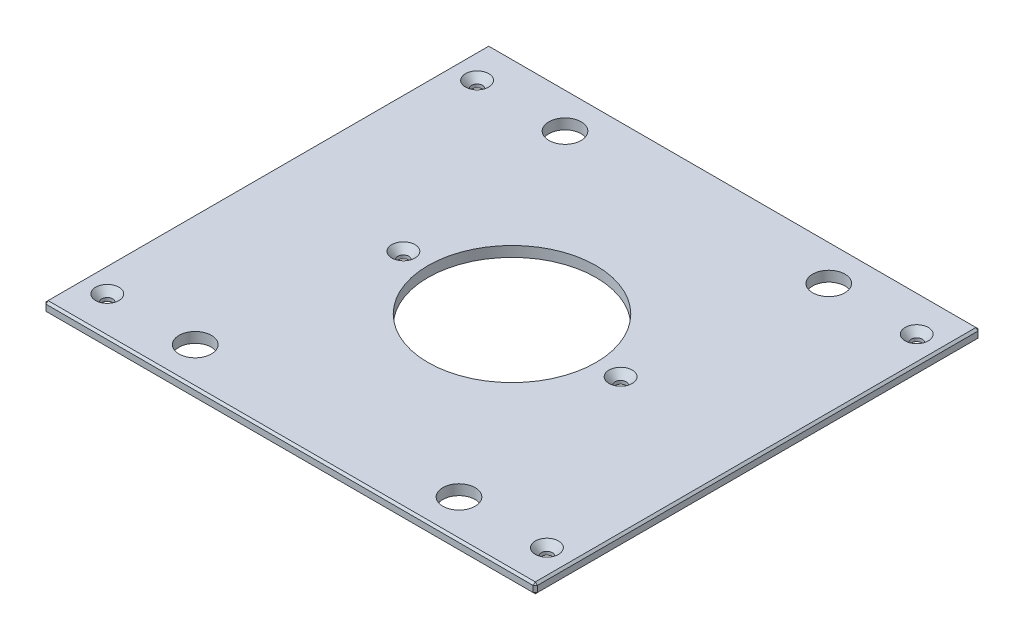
ISO-10303-21;
HEADER;
FILE_DESCRIPTION(('STEP AP214'),'2;1');
FILE_NAME('part.step','',(''),(''),'','','');
FILE_SCHEMA(('AUTOMOTIVE_DESIGN { 1 0 10303 214 1 1 1 1 }'));
ENDSEC;
DATA;
#1=APPLICATION_CONTEXT('core data for automotive mechanical design processes');
#2=APPLICATION_PROTOCOL_DEFINITION('international standard','automotive_design',2000,#1);
#3=PRODUCT_CONTEXT('',#1,'mechanical');
#4=PRODUCT('Part','Part','',(#3));
#5=PRODUCT_RELATED_PRODUCT_CATEGORY('part','',(#4));
#6=PRODUCT_DEFINITION_FORMATION('','',#4);
#7=PRODUCT_DEFINITION_CONTEXT('part definition',#1,'design');
#8=PRODUCT_DEFINITION('design','',#6,#7);
#9=PRODUCT_DEFINITION_SHAPE('','',#8);
#10=(LENGTH_UNIT() NAMED_UNIT(*) SI_UNIT(.MILLI.,.METRE.));
#11=(NAMED_UNIT(*) PLANE_ANGLE_UNIT() SI_UNIT($,.RADIAN.));
#12=(NAMED_UNIT(*) SI_UNIT($,.STERADIAN.) SOLID_ANGLE_UNIT());
#13=UNCERTAINTY_MEASURE_WITH_UNIT(LENGTH_MEASURE(1.E-05),#10,'distance_accuracy_value','');
#14=(GEOMETRIC_REPRESENTATION_CONTEXT(3) GLOBAL_UNCERTAINTY_ASSIGNED_CONTEXT((#13)) GLOBAL_UNIT_ASSIGNED_CONTEXT((#10,
#11,#12)) REPRESENTATION_CONTEXT('',''));
#15=CARTESIAN_POINT('',(0.,0.,0.));
#16=DIRECTION('',(0.,0.,1.));
#17=DIRECTION('',(1.,0.,0.));
#18=AXIS2_PLACEMENT_3D('',#15,#16,#17);
#19=CARTESIAN_POINT('',(-150.8125,6.35,-136.525));
#20=DIRECTION('',(1.,0.,0.));
#21=DIRECTION('',(0.,0.,-1.));
#22=AXIS2_PLACEMENT_3D('',#19,#20,#21);
#23=PLANE('',#22);
#24=DIRECTION('',(0.,0.,-1.));
#25=VECTOR('',#24,1.);
#26=CARTESIAN_POINT('',(-150.8125,5.08000000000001,-136.525));
#27=LINE('',#26,#25);
#28=CARTESIAN_POINT('',(-150.8125,5.08000000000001,135.255));
#29=VERTEX_POINT('',#28);
#30=CARTESIAN_POINT('',(-150.8125,5.08000000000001,-135.255));
#31=VERTEX_POINT('',#30);
#32=EDGE_CURVE('E135',#29,#31,#27,.T.);
#33=ORIENTED_EDGE('',*,*,#32,.T.);
#34=DIRECTION('',(0.,-1.,0.));
#35=VECTOR('',#34,1.);
#36=CARTESIAN_POINT('',(-150.8125,6.35,-135.255));
#37=LINE('',#36,#35);
#38=CARTESIAN_POINT('',(-150.8125,1.26999999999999,-135.255));
#39=VERTEX_POINT('',#38);
#40=EDGE_CURVE('E131',#31,#39,#37,.T.);
#41=ORIENTED_EDGE('',*,*,#40,.T.);
#42=DIRECTION('',(0.,0.,1.));
#43=VECTOR('',#42,1.);
#44=CARTESIAN_POINT('',(-150.8125,1.26999999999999,-136.525));
#45=LINE('',#44,#43);
#46=CARTESIAN_POINT('',(-150.8125,1.26999999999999,135.255));
#47=VERTEX_POINT('',#46);
#48=EDGE_CURVE('E126',#39,#47,#45,.T.);
#49=ORIENTED_EDGE('',*,*,#48,.T.);
#50=DIRECTION('',(0.,1.,0.));
#51=VECTOR('',#50,1.);
#52=CARTESIAN_POINT('',(-150.8125,6.35,135.255));
#53=LINE('',#52,#51);
#54=EDGE_CURVE('E128',#47,#29,#53,.T.);
#55=ORIENTED_EDGE('',*,*,#54,.T.);
#56=EDGE_LOOP('',(#33,#41,#49,#55));
#57=FACE_BOUND('',#56,.T.);
#58=ADVANCED_FACE('F35',(#57),#23,.F.);
#59=CARTESIAN_POINT('',(-150.8125,6.35,136.525));
#60=DIRECTION('',(0.,0.,-1.));
#61=DIRECTION('',(-1.,0.,0.));
#62=AXIS2_PLACEMENT_3D('',#59,#60,#61);
#63=PLANE('',#62);
#64=DIRECTION('',(1.,0.,0.));
#65=VECTOR('',#64,1.);
#66=CARTESIAN_POINT('',(-150.8125,1.26999999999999,136.525));
#67=LINE('',#66,#65);
#68=CARTESIAN_POINT('',(-149.5425,1.26999999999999,136.525));
#69=VERTEX_POINT('',#68);
#70=CARTESIAN_POINT('',(149.5425,1.26999999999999,136.525));
#71=VERTEX_POINT('',#70);
#72=EDGE_CURVE('E58',#69,#71,#67,.T.);
#73=ORIENTED_EDGE('',*,*,#72,.T.);
#74=DIRECTION('',(0.,1.,0.));
#75=VECTOR('',#74,1.);
#76=CARTESIAN_POINT('',(149.5425,6.35,136.525));
#77=LINE('',#76,#75);
#78=CARTESIAN_POINT('',(149.5425,5.08000000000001,136.525));
#79=VERTEX_POINT('',#78);
#80=EDGE_CURVE('E11',#71,#79,#77,.T.);
#81=ORIENTED_EDGE('',*,*,#80,.T.);
#82=DIRECTION('',(-1.,0.,0.));
#83=VECTOR('',#82,1.);
#84=CARTESIAN_POINT('',(-150.8125,5.08000000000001,136.525));
#85=LINE('',#84,#83);
#86=CARTESIAN_POINT('',(-149.5425,5.08000000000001,136.525));
#87=VERTEX_POINT('',#86);
#88=EDGE_CURVE('E44',#79,#87,#85,.T.);
#89=ORIENTED_EDGE('',*,*,#88,.T.);
#90=DIRECTION('',(0.,-1.,0.));
#91=VECTOR('',#90,1.);
#92=CARTESIAN_POINT('',(-149.5425,6.35,136.525));
#93=LINE('',#92,#91);
#94=EDGE_CURVE('E279',#87,#69,#93,.T.);
#95=ORIENTED_EDGE('',*,*,#94,.T.);
#96=EDGE_LOOP('',(#73,#81,#89,#95));
#97=FACE_BOUND('',#96,.T.);
#98=ADVANCED_FACE('F348',(#97),#63,.F.);
#99=CARTESIAN_POINT('',(150.8125,6.35,-136.525));
#100=DIRECTION('',(-1.,0.,0.));
#101=DIRECTION('',(0.,0.,1.));
#102=AXIS2_PLACEMENT_3D('',#99,#100,#101);
#103=PLANE('',#102);
#104=DIRECTION('',(0.,0.,-1.));
#105=VECTOR('',#104,1.);
#106=CARTESIAN_POINT('',(150.8125,1.26999999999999,-136.525));
#107=LINE('',#106,#105);
#108=CARTESIAN_POINT('',(150.8125,1.26999999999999,135.255));
#109=VERTEX_POINT('',#108);
#110=CARTESIAN_POINT('',(150.8125,1.26999999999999,-135.255));
#111=VERTEX_POINT('',#110);
#112=EDGE_CURVE('E274',#109,#111,#107,.T.);
#113=ORIENTED_EDGE('',*,*,#112,.T.);
#114=DIRECTION('',(0.,1.,0.));
#115=VECTOR('',#114,1.);
#116=CARTESIAN_POINT('',(150.8125,6.35,-135.255));
#117=LINE('',#116,#115);
#118=CARTESIAN_POINT('',(150.8125,5.08000000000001,-135.255));
#119=VERTEX_POINT('',#118);
#120=EDGE_CURVE('E276',#111,#119,#117,.T.);
#121=ORIENTED_EDGE('',*,*,#120,.T.);
#122=DIRECTION('',(0.,0.,1.));
#123=VECTOR('',#122,1.);
#124=CARTESIAN_POINT('',(150.8125,5.08000000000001,136.525));
#125=LINE('',#124,#123);
#126=CARTESIAN_POINT('',(150.8125,5.08000000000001,135.255));
#127=VERTEX_POINT('',#126);
#128=EDGE_CURVE('E272',#119,#127,#125,.T.);
#129=ORIENTED_EDGE('',*,*,#128,.T.);
#130=DIRECTION('',(0.,-1.,0.));
#131=VECTOR('',#130,1.);
#132=CARTESIAN_POINT('',(150.8125,6.35,135.255));
#133=LINE('',#132,#131);
#134=EDGE_CURVE('E270',#127,#109,#133,.T.);
#135=ORIENTED_EDGE('',*,*,#134,.T.);
#136=EDGE_LOOP('',(#113,#121,#129,#135));
#137=FACE_BOUND('',#136,.T.);
#138=ADVANCED_FACE('F335',(#137),#103,.F.);
#139=CARTESIAN_POINT('',(-150.8125,6.35,-136.525));
#140=DIRECTION('',(0.,0.,1.));
#141=DIRECTION('',(1.,0.,0.));
#142=AXIS2_PLACEMENT_3D('',#139,#140,#141);
#143=PLANE('',#142);
#144=DIRECTION('',(-1.,0.,0.));
#145=VECTOR('',#144,1.);
#146=CARTESIAN_POINT('',(-150.8125,1.26999999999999,-136.525));
#147=LINE('',#146,#145);
#148=CARTESIAN_POINT('',(149.5425,1.26999999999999,-136.525));
#149=VERTEX_POINT('',#148);
#150=CARTESIAN_POINT('',(-149.5425,1.26999999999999,-136.525));
#151=VERTEX_POINT('',#150);
#152=EDGE_CURVE('E246',#149,#151,#147,.T.);
#153=ORIENTED_EDGE('',*,*,#152,.T.);
#154=DIRECTION('',(0.,1.,0.));
#155=VECTOR('',#154,1.);
#156=CARTESIAN_POINT('',(-149.5425,6.35,-136.525));
#157=LINE('',#156,#155);
#158=CARTESIAN_POINT('',(-149.5425,5.08000000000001,-136.525));
#159=VERTEX_POINT('',#158);
#160=EDGE_CURVE('E250',#151,#159,#157,.T.);
#161=ORIENTED_EDGE('',*,*,#160,.T.);
#162=DIRECTION('',(1.,0.,0.));
#163=VECTOR('',#162,1.);
#164=CARTESIAN_POINT('',(150.8125,5.08000000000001,-136.525));
#165=LINE('',#164,#163);
#166=CARTESIAN_POINT('',(149.5425,5.08000000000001,-136.525));
#167=VERTEX_POINT('',#166);
#168=EDGE_CURVE('E248',#159,#167,#165,.T.);
#169=ORIENTED_EDGE('',*,*,#168,.T.);
#170=DIRECTION('',(0.,-1.,0.));
#171=VECTOR('',#170,1.);
#172=CARTESIAN_POINT('',(149.5425,6.35,-136.525));
#173=LINE('',#172,#171);
#174=EDGE_CURVE('E244',#167,#149,#173,.T.);
#175=ORIENTED_EDGE('',*,*,#174,.T.);
#176=EDGE_LOOP('',(#153,#161,#169,#175));
#177=FACE_BOUND('',#176,.T.);
#178=ADVANCED_FACE('F309',(#177),#143,.F.);
#179=CARTESIAN_POINT('',(0.,6.35,0.));
#180=DIRECTION('',(0.,1.,0.));
#181=DIRECTION('',(0.,0.,1.));
#182=AXIS2_PLACEMENT_3D('',#179,#180,#181);
#183=PLANE('',#182);
#184=CARTESIAN_POINT('',(134.9375,6.35,-113.50498));
#185=DIRECTION('',(0.,1.,0.));
#186=DIRECTION('',(0.,0.,1.));
#187=AXIS2_PLACEMENT_3D('',#184,#185,#186);
#188=CIRCLE('',#187,7.13739999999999);
#189=CARTESIAN_POINT('',(134.9375,6.35,-106.36758));
#190=VERTEX_POINT('',#189);
#191=EDGE_CURVE('E752',#190,#190,#188,.T.);
#192=ORIENTED_EDGE('',*,*,#191,.F.);
#193=EDGE_LOOP('',(#192));
#194=FACE_BOUND('',#193,.T.);
#195=CARTESIAN_POINT('',(134.9375,6.35,113.50498));
#196=DIRECTION('',(0.,1.,0.));
#197=DIRECTION('',(0.,0.,1.));
#198=AXIS2_PLACEMENT_3D('',#195,#196,#197);
#199=CIRCLE('',#198,7.13739999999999);
#200=CARTESIAN_POINT('',(134.9375,6.35,120.64238));
#201=VERTEX_POINT('',#200);
#202=EDGE_CURVE('E756',#201,#201,#199,.T.);
#203=ORIENTED_EDGE('',*,*,#202,.F.);
#204=EDGE_LOOP('',(#203));
#205=FACE_BOUND('',#204,.T.);
#206=CARTESIAN_POINT('',(-134.9375,6.35,113.50498));
#207=DIRECTION('',(0.,1.,0.));
#208=DIRECTION('',(0.,0.,1.));
#209=AXIS2_PLACEMENT_3D('',#206,#207,#208);
#210=CIRCLE('',#209,7.13739999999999);
#211=CARTESIAN_POINT('',(-134.9375,6.35,120.64238));
#212=VERTEX_POINT('',#211);
#213=EDGE_CURVE('E760',#212,#212,#210,.T.);
#214=ORIENTED_EDGE('',*,*,#213,.F.);
#215=EDGE_LOOP('',(#214));
#216=FACE_BOUND('',#215,.T.);
#217=CARTESIAN_POINT('',(-66.675,6.35,0.));
#218=DIRECTION('',(0.,1.,0.));
#219=DIRECTION('',(0.,0.,1.));
#220=AXIS2_PLACEMENT_3D('',#217,#218,#219);
#221=CIRCLE('',#220,7.1374);
#222=CARTESIAN_POINT('',(-66.675,6.35,7.1374));
#223=VERTEX_POINT('',#222);
#224=EDGE_CURVE('E764',#223,#223,#221,.T.);
#225=ORIENTED_EDGE('',*,*,#224,.F.);
#226=EDGE_LOOP('',(#225));
#227=FACE_BOUND('',#226,.T.);
#228=CARTESIAN_POINT('',(66.675,6.35,0.));
#229=DIRECTION('',(0.,1.,0.));
#230=DIRECTION('',(0.,0.,1.));
#231=AXIS2_PLACEMENT_3D('',#228,#229,#230);
#232=CIRCLE('',#231,7.1374);
#233=CARTESIAN_POINT('',(66.675,6.35,7.1374));
#234=VERTEX_POINT('',#233);
#235=EDGE_CURVE('E768',#234,#234,#232,.T.);
#236=ORIENTED_EDGE('',*,*,#235,.F.);
#237=EDGE_LOOP('',(#236));
#238=FACE_BOUND('',#237,.T.);
#239=CARTESIAN_POINT('',(-134.9375,6.35,-113.50498));
#240=DIRECTION('',(0.,1.,0.));
#241=DIRECTION('',(0.,0.,1.));
#242=AXIS2_PLACEMENT_3D('',#239,#240,#241);
#243=CIRCLE('',#242,7.13739999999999);
#244=CARTESIAN_POINT('',(-134.9375,6.35,-106.36758));
#245=VERTEX_POINT('',#244);
#246=EDGE_CURVE('E771',#245,#245,#243,.T.);
#247=ORIENTED_EDGE('',*,*,#246,.F.);
#248=EDGE_LOOP('',(#247));
#249=FACE_BOUND('',#248,.T.);
#250=DIRECTION('',(0.,0.,-1.));
#251=VECTOR('',#250,1.);
#252=CARTESIAN_POINT('',(149.5425,6.35,-136.525));
#253=LINE('',#252,#251);
#254=CARTESIAN_POINT('',(149.5425,6.35,135.255));
#255=VERTEX_POINT('',#254);
#256=CARTESIAN_POINT('',(149.5425,6.35,-135.255));
#257=VERTEX_POINT('',#256);
#258=EDGE_CURVE('E257',#255,#257,#253,.T.);
#259=ORIENTED_EDGE('',*,*,#258,.T.);
#260=DIRECTION('',(-1.,0.,0.));
#261=VECTOR('',#260,1.);
#262=CARTESIAN_POINT('',(-150.8125,6.35,-135.255));
#263=LINE('',#262,#261);
#264=CARTESIAN_POINT('',(-149.5425,6.35,-135.255));
#265=VERTEX_POINT('',#264);
#266=EDGE_CURVE('E259',#257,#265,#263,.T.);
#267=ORIENTED_EDGE('',*,*,#266,.T.);
#268=DIRECTION('',(0.,0.,1.));
#269=VECTOR('',#268,1.);
#270=CARTESIAN_POINT('',(-149.5425,6.35,136.525));
#271=LINE('',#270,#269);
#272=CARTESIAN_POINT('',(-149.5425,6.35,135.255));
#273=VERTEX_POINT('',#272);
#274=EDGE_CURVE('E255',#265,#273,#271,.T.);
#275=ORIENTED_EDGE('',*,*,#274,.T.);
#276=DIRECTION('',(1.,0.,0.));
#277=VECTOR('',#276,1.);
#278=CARTESIAN_POINT('',(150.8125,6.35,135.255));
#279=LINE('',#278,#277);
#280=EDGE_CURVE('E253',#273,#255,#279,.T.);
#281=ORIENTED_EDGE('',*,*,#280,.T.);
#282=EDGE_LOOP('',(#259,#267,#275,#281));
#283=FACE_BOUND('',#282,.T.);
#284=CARTESIAN_POINT('',(80.9625,6.35,-113.50498));
#285=DIRECTION('',(0.,1.,0.));
#286=DIRECTION('',(0.,0.,1.));
#287=AXIS2_PLACEMENT_3D('',#284,#285,#286);
#288=CIRCLE('',#287,9.921875);
#289=CARTESIAN_POINT('',(80.9625,6.35,-103.583105));
#290=VERTEX_POINT('',#289);
#291=EDGE_CURVE('E204',#290,#290,#288,.T.);
#292=ORIENTED_EDGE('',*,*,#291,.F.);
#293=EDGE_LOOP('',(#292));
#294=FACE_BOUND('',#293,.T.);
#295=CARTESIAN_POINT('',(-80.9625,6.35,-113.50498));
#296=DIRECTION('',(0.,1.,0.));
#297=DIRECTION('',(0.,0.,1.));
#298=AXIS2_PLACEMENT_3D('',#295,#296,#297);
#299=CIRCLE('',#298,9.921875);
#300=CARTESIAN_POINT('',(-80.9625,6.35,-103.583105));
#301=VERTEX_POINT('',#300);
#302=EDGE_CURVE('E214',#301,#301,#299,.T.);
#303=ORIENTED_EDGE('',*,*,#302,.F.);
#304=EDGE_LOOP('',(#303));
#305=FACE_BOUND('',#304,.T.);
#306=CARTESIAN_POINT('',(80.9625,6.35,113.50498));
#307=DIRECTION('',(0.,1.,0.));
#308=DIRECTION('',(0.,0.,1.));
#309=AXIS2_PLACEMENT_3D('',#306,#307,#308);
#310=CIRCLE('',#309,9.921875);
#311=CARTESIAN_POINT('',(80.9625,6.35,123.426855));
#312=VERTEX_POINT('',#311);
#313=EDGE_CURVE('E225',#312,#312,#310,.T.);
#314=ORIENTED_EDGE('',*,*,#313,.F.);
#315=EDGE_LOOP('',(#314));
#316=FACE_BOUND('',#315,.T.);
#317=CARTESIAN_POINT('',(-80.9625,6.35,113.50498));
#318=DIRECTION('',(0.,1.,0.));
#319=DIRECTION('',(0.,0.,1.));
#320=AXIS2_PLACEMENT_3D('',#317,#318,#319);
#321=CIRCLE('',#320,9.921875);
#322=CARTESIAN_POINT('',(-80.9625,6.35,123.426855));
#323=VERTEX_POINT('',#322);
#324=EDGE_CURVE('E231',#323,#323,#321,.T.);
#325=ORIENTED_EDGE('',*,*,#324,.F.);
#326=EDGE_LOOP('',(#325));
#327=FACE_BOUND('',#326,.T.);
#328=CARTESIAN_POINT('',(0.,6.35,0.));
#329=DIRECTION('',(0.,1.,0.));
#330=DIRECTION('',(0.,0.,1.));
#331=AXIS2_PLACEMENT_3D('',#328,#329,#330);
#332=CIRCLE('',#331,51.562);
#333=CARTESIAN_POINT('',(0.,6.35,51.562));
#334=VERTEX_POINT('',#333);
#335=EDGE_CURVE('E237',#334,#334,#332,.T.);
#336=ORIENTED_EDGE('',*,*,#335,.F.);
#337=EDGE_LOOP('',(#336));
#338=FACE_BOUND('',#337,.T.);
#339=ADVANCED_FACE('F357',(#194,#205,#216,#227,#238,#249,#283,#294,#305,#316,#327,#338),#183,.T.);
#340=CARTESIAN_POINT('',(0.,0.,0.));
#341=DIRECTION('',(0.,1.,0.));
#342=DIRECTION('',(0.,0.,1.));
#343=AXIS2_PLACEMENT_3D('',#340,#341,#342);
#344=PLANE('',#343);
#345=CARTESIAN_POINT('',(134.9375,0.,-113.50498));
#346=DIRECTION('',(0.,1.,0.));
#347=DIRECTION('',(0.,0.,1.));
#348=AXIS2_PLACEMENT_3D('',#345,#346,#347);
#349=CIRCLE('',#348,3.3782);
#350=CARTESIAN_POINT('',(134.9375,0.,-110.12678));
#351=VERTEX_POINT('',#350);
#352=EDGE_CURVE('E805',#351,#351,#349,.T.);
#353=ORIENTED_EDGE('',*,*,#352,.T.);
#354=EDGE_LOOP('',(#353));
#355=FACE_BOUND('',#354,.T.);
#356=CARTESIAN_POINT('',(134.9375,0.,113.50498));
#357=DIRECTION('',(0.,1.,0.));
#358=DIRECTION('',(0.,0.,1.));
#359=AXIS2_PLACEMENT_3D('',#356,#357,#358);
#360=CIRCLE('',#359,3.3782);
#361=CARTESIAN_POINT('',(134.9375,0.,116.88318));
#362=VERTEX_POINT('',#361);
#363=EDGE_CURVE('E798',#362,#362,#360,.T.);
#364=ORIENTED_EDGE('',*,*,#363,.T.);
#365=EDGE_LOOP('',(#364));
#366=FACE_BOUND('',#365,.T.);
#367=CARTESIAN_POINT('',(-134.9375,0.,113.50498));
#368=DIRECTION('',(0.,1.,0.));
#369=DIRECTION('',(0.,0.,1.));
#370=AXIS2_PLACEMENT_3D('',#367,#368,#369);
#371=CIRCLE('',#370,3.3782);
#372=CARTESIAN_POINT('',(-134.9375,0.,116.88318));
#373=VERTEX_POINT('',#372);
#374=EDGE_CURVE('E791',#373,#373,#371,.T.);
#375=ORIENTED_EDGE('',*,*,#374,.T.);
#376=EDGE_LOOP('',(#375));
#377=FACE_BOUND('',#376,.T.);
#378=CARTESIAN_POINT('',(-66.675,0.,0.));
#379=DIRECTION('',(0.,1.,0.));
#380=DIRECTION('',(0.,0.,1.));
#381=AXIS2_PLACEMENT_3D('',#378,#379,#380);
#382=CIRCLE('',#381,3.3782);
#383=CARTESIAN_POINT('',(-66.675,0.,3.3782));
#384=VERTEX_POINT('',#383);
#385=EDGE_CURVE('E784',#384,#384,#382,.T.);
#386=ORIENTED_EDGE('',*,*,#385,.T.);
#387=EDGE_LOOP('',(#386));
#388=FACE_BOUND('',#387,.T.);
#389=CARTESIAN_POINT('',(66.675,0.,0.));
#390=DIRECTION('',(0.,1.,0.));
#391=DIRECTION('',(0.,0.,1.));
#392=AXIS2_PLACEMENT_3D('',#389,#390,#391);
#393=CIRCLE('',#392,3.3782);
#394=CARTESIAN_POINT('',(66.675,0.,3.3782));
#395=VERTEX_POINT('',#394);
#396=EDGE_CURVE('E774',#395,#395,#393,.T.);
#397=ORIENTED_EDGE('',*,*,#396,.T.);
#398=EDGE_LOOP('',(#397));
#399=FACE_BOUND('',#398,.T.);
#400=CARTESIAN_POINT('',(-134.9375,0.,-113.50498));
#401=DIRECTION('',(0.,1.,0.));
#402=DIRECTION('',(0.,0.,1.));
#403=AXIS2_PLACEMENT_3D('',#400,#401,#402);
#404=CIRCLE('',#403,3.3782);
#405=CARTESIAN_POINT('',(-134.9375,0.,-110.12678));
#406=VERTEX_POINT('',#405);
#407=EDGE_CURVE('E217',#406,#406,#404,.T.);
#408=ORIENTED_EDGE('',*,*,#407,.T.);
#409=EDGE_LOOP('',(#408));
#410=FACE_BOUND('',#409,.T.);
#411=DIRECTION('',(0.,0.,-1.));
#412=VECTOR('',#411,1.);
#413=CARTESIAN_POINT('',(-149.5425,0.,0.));
#414=LINE('',#413,#412);
#415=CARTESIAN_POINT('',(-149.5425,0.,135.255));
#416=VERTEX_POINT('',#415);
#417=CARTESIAN_POINT('',(-149.5425,0.,-135.255));
#418=VERTEX_POINT('',#417);
#419=EDGE_CURVE('E158',#416,#418,#414,.T.);
#420=ORIENTED_EDGE('',*,*,#419,.T.);
#421=DIRECTION('',(1.,0.,0.));
#422=VECTOR('',#421,1.);
#423=CARTESIAN_POINT('',(0.,0.,-135.255));
#424=LINE('',#423,#422);
#425=CARTESIAN_POINT('',(149.5425,0.,-135.255));
#426=VERTEX_POINT('',#425);
#427=EDGE_CURVE('E267',#418,#426,#424,.T.);
#428=ORIENTED_EDGE('',*,*,#427,.T.);
#429=DIRECTION('',(0.,0.,1.));
#430=VECTOR('',#429,1.);
#431=CARTESIAN_POINT('',(149.5425,0.,0.));
#432=LINE('',#431,#430);
#433=CARTESIAN_POINT('',(149.5425,0.,135.255));
#434=VERTEX_POINT('',#433);
#435=EDGE_CURVE('E265',#426,#434,#432,.T.);
#436=ORIENTED_EDGE('',*,*,#435,.T.);
#437=DIRECTION('',(-1.,0.,0.));
#438=VECTOR('',#437,1.);
#439=CARTESIAN_POINT('',(0.,0.,135.255));
#440=LINE('',#439,#438);
#441=EDGE_CURVE('E262',#434,#416,#440,.T.);
#442=ORIENTED_EDGE('',*,*,#441,.T.);
#443=EDGE_LOOP('',(#420,#428,#436,#442));
#444=FACE_BOUND('',#443,.T.);
#445=CARTESIAN_POINT('',(80.9625,0.,-113.50498));
#446=DIRECTION('',(0.,1.,0.));
#447=DIRECTION('',(0.,0.,1.));
#448=AXIS2_PLACEMENT_3D('',#445,#446,#447);
#449=CIRCLE('',#448,9.921875);
#450=CARTESIAN_POINT('',(80.9625,0.,-103.583105));
#451=VERTEX_POINT('',#450);
#452=EDGE_CURVE('E209',#451,#451,#449,.T.);
#453=ORIENTED_EDGE('',*,*,#452,.T.);
#454=EDGE_LOOP('',(#453));
#455=FACE_BOUND('',#454,.T.);
#456=CARTESIAN_POINT('',(-80.9625,0.,-113.50498));
#457=DIRECTION('',(0.,1.,0.));
#458=DIRECTION('',(0.,0.,1.));
#459=AXIS2_PLACEMENT_3D('',#456,#457,#458);
#460=CIRCLE('',#459,9.921875);
#461=CARTESIAN_POINT('',(-80.9625,0.,-103.583105));
#462=VERTEX_POINT('',#461);
#463=EDGE_CURVE('E222',#462,#462,#460,.T.);
#464=ORIENTED_EDGE('',*,*,#463,.T.);
#465=EDGE_LOOP('',(#464));
#466=FACE_BOUND('',#465,.T.);
#467=CARTESIAN_POINT('',(80.9625,0.,113.50498));
#468=DIRECTION('',(0.,1.,0.));
#469=DIRECTION('',(0.,0.,1.));
#470=AXIS2_PLACEMENT_3D('',#467,#468,#469);
#471=CIRCLE('',#470,9.921875);
#472=CARTESIAN_POINT('',(80.9625,0.,123.426855));
#473=VERTEX_POINT('',#472);
#474=EDGE_CURVE('E228',#473,#473,#471,.T.);
#475=ORIENTED_EDGE('',*,*,#474,.T.);
#476=EDGE_LOOP('',(#475));
#477=FACE_BOUND('',#476,.T.);
#478=CARTESIAN_POINT('',(-80.9625,0.,113.50498));
#479=DIRECTION('',(0.,1.,0.));
#480=DIRECTION('',(0.,0.,1.));
#481=AXIS2_PLACEMENT_3D('',#478,#479,#480);
#482=CIRCLE('',#481,9.921875);
#483=CARTESIAN_POINT('',(-80.9625,0.,123.426855));
#484=VERTEX_POINT('',#483);
#485=EDGE_CURVE('E234',#484,#484,#482,.T.);
#486=ORIENTED_EDGE('',*,*,#485,.T.);
#487=EDGE_LOOP('',(#486));
#488=FACE_BOUND('',#487,.T.);
#489=CARTESIAN_POINT('',(0.,0.,0.));
#490=DIRECTION('',(0.,1.,0.));
#491=DIRECTION('',(0.,0.,1.));
#492=AXIS2_PLACEMENT_3D('',#489,#490,#491);
#493=CIRCLE('',#492,51.562);
#494=CARTESIAN_POINT('',(0.,0.,51.562));
#495=VERTEX_POINT('',#494);
#496=EDGE_CURVE('E147',#495,#495,#493,.T.);
#497=ORIENTED_EDGE('',*,*,#496,.T.);
#498=EDGE_LOOP('',(#497));
#499=FACE_BOUND('',#498,.T.);
#500=ADVANCED_FACE('F322',(#355,#366,#377,#388,#399,#410,#444,#455,#466,#477,#488,#499),#344,.F.);
#501=CARTESIAN_POINT('',(0.,0.,0.));
#502=DIRECTION('',(0.,1.,0.));
#503=DIRECTION('',(0.,0.,1.));
#504=AXIS2_PLACEMENT_3D('',#501,#502,#503);
#505=CYLINDRICAL_SURFACE('',#504,51.562);
#506=ORIENTED_EDGE('',*,*,#496,.F.);
#507=EDGE_LOOP('',(#506));
#508=FACE_BOUND('',#507,.T.);
#509=ORIENTED_EDGE('',*,*,#335,.T.);
#510=EDGE_LOOP('',(#509));
#511=FACE_BOUND('',#510,.T.);
#512=ADVANCED_FACE('F691',(#508,#511),#505,.F.);
#513=CARTESIAN_POINT('',(-80.9625,6.35,113.50498));
#514=DIRECTION('',(0.,1.,0.));
#515=DIRECTION('',(0.,0.,1.));
#516=AXIS2_PLACEMENT_3D('',#513,#514,#515);
#517=CYLINDRICAL_SURFACE('',#516,9.921875);
#518=ORIENTED_EDGE('',*,*,#485,.F.);
#519=EDGE_LOOP('',(#518));
#520=FACE_BOUND('',#519,.T.);
#521=ORIENTED_EDGE('',*,*,#324,.T.);
#522=EDGE_LOOP('',(#521));
#523=FACE_BOUND('',#522,.T.);
#524=ADVANCED_FACE('F682',(#520,#523),#517,.F.);
#525=CARTESIAN_POINT('',(80.9625,6.35,113.50498));
#526=DIRECTION('',(0.,1.,0.));
#527=DIRECTION('',(0.,0.,1.));
#528=AXIS2_PLACEMENT_3D('',#525,#526,#527);
#529=CYLINDRICAL_SURFACE('',#528,9.921875);
#530=ORIENTED_EDGE('',*,*,#474,.F.);
#531=EDGE_LOOP('',(#530));
#532=FACE_BOUND('',#531,.T.);
#533=ORIENTED_EDGE('',*,*,#313,.T.);
#534=EDGE_LOOP('',(#533));
#535=FACE_BOUND('',#534,.T.);
#536=ADVANCED_FACE('F673',(#532,#535),#529,.F.);
#537=CARTESIAN_POINT('',(-80.9625,6.35,-113.50498));
#538=DIRECTION('',(0.,1.,0.));
#539=DIRECTION('',(0.,0.,1.));
#540=AXIS2_PLACEMENT_3D('',#537,#538,#539);
#541=CYLINDRICAL_SURFACE('',#540,9.921875);
#542=ORIENTED_EDGE('',*,*,#463,.F.);
#543=EDGE_LOOP('',(#542));
#544=FACE_BOUND('',#543,.T.);
#545=ORIENTED_EDGE('',*,*,#302,.T.);
#546=EDGE_LOOP('',(#545));
#547=FACE_BOUND('',#546,.T.);
#548=ADVANCED_FACE('F663',(#544,#547),#541,.F.);
#549=CARTESIAN_POINT('',(80.9625,6.35,-113.50498));
#550=DIRECTION('',(0.,1.,0.));
#551=DIRECTION('',(0.,0.,1.));
#552=AXIS2_PLACEMENT_3D('',#549,#550,#551);
#553=CYLINDRICAL_SURFACE('',#552,9.921875);
#554=ORIENTED_EDGE('',*,*,#452,.F.);
#555=EDGE_LOOP('',(#554));
#556=FACE_BOUND('',#555,.T.);
#557=ORIENTED_EDGE('',*,*,#291,.T.);
#558=EDGE_LOOP('',(#557));
#559=FACE_BOUND('',#558,.T.);
#560=ADVANCED_FACE('F366',(#556,#559),#553,.F.);
#561=CARTESIAN_POINT('',(150.8125,6.35,135.255));
#562=DIRECTION('',(-0.707106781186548,0.,-0.707106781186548));
#563=DIRECTION('',(0.,-1.,0.));
#564=AXIS2_PLACEMENT_3D('',#561,#562,#563);
#565=PLANE('',#564);
#566=DIRECTION('',(-0.707106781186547,0.,0.707106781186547));
#567=VECTOR('',#566,1.);
#568=CARTESIAN_POINT('',(150.8125,5.08000000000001,135.255));
#569=LINE('',#568,#567);
#570=EDGE_CURVE('E39',#79,#127,#569,.F.);
#571=ORIENTED_EDGE('',*,*,#570,.F.);
#572=ORIENTED_EDGE('',*,*,#80,.F.);
#573=DIRECTION('',(0.707106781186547,0.,-0.707106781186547));
#574=VECTOR('',#573,1.);
#575=CARTESIAN_POINT('',(150.1775,1.26999999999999,135.89));
#576=LINE('',#575,#574);
#577=EDGE_CURVE('E197',#109,#71,#576,.F.);
#578=ORIENTED_EDGE('',*,*,#577,.F.);
#579=ORIENTED_EDGE('',*,*,#134,.F.);
#580=EDGE_LOOP('',(#571,#572,#578,#579));
#581=FACE_BOUND('',#580,.T.);
#582=ADVANCED_FACE('F37',(#581),#565,.F.);
#583=CARTESIAN_POINT('',(150.8125,5.08000000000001,135.255));
#584=DIRECTION('',(0.577350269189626,0.577350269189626,0.577350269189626));
#585=DIRECTION('',(0.707106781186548,0.,-0.707106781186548));
#586=AXIS2_PLACEMENT_3D('',#583,#584,#585);
#587=PLANE('',#586);
#588=DIRECTION('',(0.,-0.707106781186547,0.707106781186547));
#589=VECTOR('',#588,1.);
#590=CARTESIAN_POINT('',(149.5425,5.715,135.89));
#591=LINE('',#590,#589);
#592=EDGE_CURVE('E193',#79,#255,#591,.F.);
#593=ORIENTED_EDGE('',*,*,#592,.F.);
#594=ORIENTED_EDGE('',*,*,#570,.T.);
#595=DIRECTION('',(-0.707106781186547,0.707106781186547,0.));
#596=VECTOR('',#595,1.);
#597=CARTESIAN_POINT('',(150.8125,5.08000000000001,135.255));
#598=LINE('',#597,#596);
#599=EDGE_CURVE('E195',#255,#127,#598,.F.);
#600=ORIENTED_EDGE('',*,*,#599,.F.);
#601=EDGE_LOOP('',(#593,#594,#600));
#602=FACE_BOUND('',#601,.T.);
#603=ADVANCED_FACE('F359',(#602),#587,.T.);
#604=CARTESIAN_POINT('',(149.5425,0.,135.255));
#605=DIRECTION('',(0.577350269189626,-0.577350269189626,0.577350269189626));
#606=DIRECTION('',(0.707106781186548,0.,-0.707106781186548));
#607=AXIS2_PLACEMENT_3D('',#604,#605,#606);
#608=PLANE('',#607);
#609=DIRECTION('',(-0.707106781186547,-0.707106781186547,0.));
#610=VECTOR('',#609,1.);
#611=CARTESIAN_POINT('',(149.5425,0.,135.255));
#612=LINE('',#611,#610);
#613=EDGE_CURVE('E187',#109,#434,#612,.T.);
#614=ORIENTED_EDGE('',*,*,#613,.F.);
#615=ORIENTED_EDGE('',*,*,#577,.T.);
#616=DIRECTION('',(0.,0.707106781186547,0.707106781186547));
#617=VECTOR('',#616,1.);
#618=CARTESIAN_POINT('',(149.5425,0.,135.255));
#619=LINE('',#618,#617);
#620=EDGE_CURVE('E190',#434,#71,#619,.T.);
#621=ORIENTED_EDGE('',*,*,#620,.F.);
#622=EDGE_LOOP('',(#614,#615,#621));
#623=FACE_BOUND('',#622,.T.);
#624=ADVANCED_FACE('F328',(#623),#608,.T.);
#625=CARTESIAN_POINT('',(149.5425,6.35,0.));
#626=DIRECTION('',(0.707106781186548,0.707106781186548,0.));
#627=DIRECTION('',(0.,0.,1.));
#628=AXIS2_PLACEMENT_3D('',#625,#626,#627);
#629=PLANE('',#628);
#630=ORIENTED_EDGE('',*,*,#599,.T.);
#631=ORIENTED_EDGE('',*,*,#128,.F.);
#632=DIRECTION('',(0.707106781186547,-0.707106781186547,0.));
#633=VECTOR('',#632,1.);
#634=CARTESIAN_POINT('',(150.1775,5.715,-135.255));
#635=LINE('',#634,#633);
#636=EDGE_CURVE('E182',#257,#119,#635,.T.);
#637=ORIENTED_EDGE('',*,*,#636,.F.);
#638=ORIENTED_EDGE('',*,*,#258,.F.);
#639=EDGE_LOOP('',(#630,#631,#637,#638));
#640=FACE_BOUND('',#639,.T.);
#641=ADVANCED_FACE('F345',(#640),#629,.T.);
#642=CARTESIAN_POINT('',(0.,6.35,135.255));
#643=DIRECTION('',(0.,0.707106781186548,0.707106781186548));
#644=DIRECTION('',(-1.,0.,0.));
#645=AXIS2_PLACEMENT_3D('',#642,#643,#644);
#646=PLANE('',#645);
#647=ORIENTED_EDGE('',*,*,#592,.T.);
#648=ORIENTED_EDGE('',*,*,#280,.F.);
#649=DIRECTION('',(0.,0.707106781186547,-0.707106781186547));
#650=VECTOR('',#649,1.);
#651=CARTESIAN_POINT('',(-149.5425,6.35,135.255));
#652=LINE('',#651,#650);
#653=EDGE_CURVE('E179',#87,#273,#652,.T.);
#654=ORIENTED_EDGE('',*,*,#653,.F.);
#655=ORIENTED_EDGE('',*,*,#88,.F.);
#656=EDGE_LOOP('',(#647,#648,#654,#655));
#657=FACE_BOUND('',#656,.T.);
#658=ADVANCED_FACE('F350',(#657),#646,.T.);
#659=CARTESIAN_POINT('',(-149.5425,6.35,136.525));
#660=DIRECTION('',(0.707106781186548,0.,-0.707106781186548));
#661=DIRECTION('',(0.,-1.,0.));
#662=AXIS2_PLACEMENT_3D('',#659,#660,#661);
#663=PLANE('',#662);
#664=DIRECTION('',(0.707106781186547,0.,0.707106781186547));
#665=VECTOR('',#664,1.);
#666=CARTESIAN_POINT('',(-150.8125,1.26999999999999,135.255));
#667=LINE('',#666,#665);
#668=EDGE_CURVE('E142',#69,#47,#667,.F.);
#669=ORIENTED_EDGE('',*,*,#668,.F.);
#670=ORIENTED_EDGE('',*,*,#94,.F.);
#671=DIRECTION('',(-0.707106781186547,0.,-0.707106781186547));
#672=VECTOR('',#671,1.);
#673=CARTESIAN_POINT('',(-150.1775,5.08000000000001,135.89));
#674=LINE('',#673,#672);
#675=EDGE_CURVE('E145',#29,#87,#674,.F.);
#676=ORIENTED_EDGE('',*,*,#675,.F.);
#677=ORIENTED_EDGE('',*,*,#54,.F.);
#678=EDGE_LOOP('',(#669,#670,#676,#677));
#679=FACE_BOUND('',#678,.T.);
#680=ADVANCED_FACE('F140',(#679),#663,.F.);
#681=CARTESIAN_POINT('',(-150.8125,1.26999999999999,136.525));
#682=DIRECTION('',(0.,0.707106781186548,-0.707106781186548));
#683=DIRECTION('',(1.,0.,0.));
#684=AXIS2_PLACEMENT_3D('',#681,#682,#683);
#685=PLANE('',#684);
#686=ORIENTED_EDGE('',*,*,#620,.T.);
#687=ORIENTED_EDGE('',*,*,#72,.F.);
#688=DIRECTION('',(0.,-0.707106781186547,-0.707106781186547));
#689=VECTOR('',#688,1.);
#690=CARTESIAN_POINT('',(-149.5425,0.634999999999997,135.89));
#691=LINE('',#690,#689);
#692=EDGE_CURVE('E155',#416,#69,#691,.F.);
#693=ORIENTED_EDGE('',*,*,#692,.F.);
#694=ORIENTED_EDGE('',*,*,#441,.F.);
#695=EDGE_LOOP('',(#686,#687,#693,#694));
#696=FACE_BOUND('',#695,.T.);
#697=ADVANCED_FACE('F327',(#696),#685,.F.);
#698=CARTESIAN_POINT('',(150.8125,1.26999999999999,-136.525));
#699=DIRECTION('',(-0.707106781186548,0.707106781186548,0.));
#700=DIRECTION('',(0.,0.,-1.));
#701=AXIS2_PLACEMENT_3D('',#698,#699,#700);
#702=PLANE('',#701);
#703=ORIENTED_EDGE('',*,*,#613,.T.);
#704=ORIENTED_EDGE('',*,*,#435,.F.);
#705=DIRECTION('',(0.707106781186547,0.707106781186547,0.));
#706=VECTOR('',#705,1.);
#707=CARTESIAN_POINT('',(149.5425,0.,-135.255));
#708=LINE('',#707,#706);
#709=EDGE_CURVE('E174',#111,#426,#708,.F.);
#710=ORIENTED_EDGE('',*,*,#709,.F.);
#711=ORIENTED_EDGE('',*,*,#112,.F.);
#712=EDGE_LOOP('',(#703,#704,#710,#711));
#713=FACE_BOUND('',#712,.T.);
#714=ADVANCED_FACE('F332',(#713),#702,.F.);
#715=CARTESIAN_POINT('',(149.5425,6.35,-136.525));
#716=DIRECTION('',(-0.707106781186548,0.,0.707106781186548));
#717=DIRECTION('',(0.,-1.,0.));
#718=AXIS2_PLACEMENT_3D('',#715,#716,#717);
#719=PLANE('',#718);
#720=DIRECTION('',(0.707106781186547,0.,0.707106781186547));
#721=VECTOR('',#720,1.);
#722=CARTESIAN_POINT('',(149.5425,5.08000000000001,-136.525));
#723=LINE('',#722,#721);
#724=EDGE_CURVE('E184',#119,#167,#723,.F.);
#725=ORIENTED_EDGE('',*,*,#724,.F.);
#726=ORIENTED_EDGE('',*,*,#120,.F.);
#727=DIRECTION('',(-0.707106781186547,0.,-0.707106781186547));
#728=VECTOR('',#727,1.);
#729=CARTESIAN_POINT('',(150.1775,1.26999999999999,-135.89));
#730=LINE('',#729,#728);
#731=EDGE_CURVE('E171',#149,#111,#730,.F.);
#732=ORIENTED_EDGE('',*,*,#731,.F.);
#733=ORIENTED_EDGE('',*,*,#174,.F.);
#734=EDGE_LOOP('',(#725,#726,#732,#733));
#735=FACE_BOUND('',#734,.T.);
#736=ADVANCED_FACE('F340',(#735),#719,.F.);
#737=CARTESIAN_POINT('',(149.5425,5.08000000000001,-136.525));
#738=DIRECTION('',(0.577350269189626,0.577350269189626,-0.577350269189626));
#739=DIRECTION('',(-0.707106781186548,0.,-0.707106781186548));
#740=AXIS2_PLACEMENT_3D('',#737,#738,#739);
#741=PLANE('',#740);
#742=ORIENTED_EDGE('',*,*,#636,.T.);
#743=ORIENTED_EDGE('',*,*,#724,.T.);
#744=DIRECTION('',(0.,0.707106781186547,0.707106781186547));
#745=VECTOR('',#744,1.);
#746=CARTESIAN_POINT('',(149.5425,5.08000000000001,-136.525));
#747=LINE('',#746,#745);
#748=EDGE_CURVE('E163',#257,#167,#747,.F.);
#749=ORIENTED_EDGE('',*,*,#748,.F.);
#750=EDGE_LOOP('',(#742,#743,#749));
#751=FACE_BOUND('',#750,.T.);
#752=ADVANCED_FACE('F398',(#751),#741,.T.);
#753=CARTESIAN_POINT('',(-149.5425,6.35,135.255));
#754=DIRECTION('',(-0.577350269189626,0.577350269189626,0.577350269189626));
#755=DIRECTION('',(0.707106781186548,0.,0.707106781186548));
#756=AXIS2_PLACEMENT_3D('',#753,#754,#755);
#757=PLANE('',#756);
#758=ORIENTED_EDGE('',*,*,#675,.T.);
#759=ORIENTED_EDGE('',*,*,#653,.T.);
#760=DIRECTION('',(-0.707106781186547,-0.707106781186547,0.));
#761=VECTOR('',#760,1.);
#762=CARTESIAN_POINT('',(-149.5425,6.35,135.255));
#763=LINE('',#762,#761);
#764=EDGE_CURVE('E159',#29,#273,#763,.F.);
#765=ORIENTED_EDGE('',*,*,#764,.F.);
#766=EDGE_LOOP('',(#758,#759,#765));
#767=FACE_BOUND('',#766,.T.);
#768=ADVANCED_FACE('F352',(#767),#757,.T.);
#769=CARTESIAN_POINT('',(-150.8125,1.26999999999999,135.255));
#770=DIRECTION('',(-0.577350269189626,-0.577350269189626,0.577350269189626));
#771=DIRECTION('',(0.707106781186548,0.,0.707106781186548));
#772=AXIS2_PLACEMENT_3D('',#769,#770,#771);
#773=PLANE('',#772);
#774=ORIENTED_EDGE('',*,*,#692,.T.);
#775=ORIENTED_EDGE('',*,*,#668,.T.);
#776=DIRECTION('',(-0.707106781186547,0.707106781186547,0.));
#777=VECTOR('',#776,1.);
#778=CARTESIAN_POINT('',(-150.8125,1.26999999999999,135.255));
#779=LINE('',#778,#777);
#780=EDGE_CURVE('E152',#416,#47,#779,.T.);
#781=ORIENTED_EDGE('',*,*,#780,.F.);
#782=EDGE_LOOP('',(#774,#775,#781));
#783=FACE_BOUND('',#782,.T.);
#784=ADVANCED_FACE('F151',(#783),#773,.T.);
#785=CARTESIAN_POINT('',(149.5425,0.,-135.255));
#786=DIRECTION('',(0.577350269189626,-0.577350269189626,-0.577350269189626));
#787=DIRECTION('',(-0.707106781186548,0.,-0.707106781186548));
#788=AXIS2_PLACEMENT_3D('',#785,#786,#787);
#789=PLANE('',#788);
#790=ORIENTED_EDGE('',*,*,#731,.T.);
#791=ORIENTED_EDGE('',*,*,#709,.T.);
#792=DIRECTION('',(0.,-0.707106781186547,0.707106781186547));
#793=VECTOR('',#792,1.);
#794=CARTESIAN_POINT('',(149.5425,0.,-135.255));
#795=LINE('',#794,#793);
#796=EDGE_CURVE('E160',#149,#426,#795,.T.);
#797=ORIENTED_EDGE('',*,*,#796,.F.);
#798=EDGE_LOOP('',(#790,#791,#797));
#799=FACE_BOUND('',#798,.T.);
#800=ADVANCED_FACE('F390',(#799),#789,.T.);
#801=CARTESIAN_POINT('',(0.,6.35,-135.255));
#802=DIRECTION('',(0.,0.707106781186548,-0.707106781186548));
#803=DIRECTION('',(1.,0.,0.));
#804=AXIS2_PLACEMENT_3D('',#801,#802,#803);
#805=PLANE('',#804);
#806=ORIENTED_EDGE('',*,*,#748,.T.);
#807=ORIENTED_EDGE('',*,*,#168,.F.);
#808=DIRECTION('',(0.,-0.707106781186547,-0.707106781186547));
#809=VECTOR('',#808,1.);
#810=CARTESIAN_POINT('',(-149.5425,5.08000000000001,-136.525));
#811=LINE('',#810,#809);
#812=EDGE_CURVE('E165',#265,#159,#811,.T.);
#813=ORIENTED_EDGE('',*,*,#812,.F.);
#814=ORIENTED_EDGE('',*,*,#266,.F.);
#815=EDGE_LOOP('',(#806,#807,#813,#814));
#816=FACE_BOUND('',#815,.T.);
#817=ADVANCED_FACE('F304',(#816),#805,.T.);
#818=CARTESIAN_POINT('',(-149.5425,6.35,0.));
#819=DIRECTION('',(-0.707106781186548,0.707106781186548,0.));
#820=DIRECTION('',(0.,0.,-1.));
#821=AXIS2_PLACEMENT_3D('',#818,#819,#820);
#822=PLANE('',#821);
#823=ORIENTED_EDGE('',*,*,#764,.T.);
#824=ORIENTED_EDGE('',*,*,#274,.F.);
#825=DIRECTION('',(0.707106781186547,0.707106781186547,0.));
#826=VECTOR('',#825,1.);
#827=CARTESIAN_POINT('',(-150.1775,5.715,-135.255));
#828=LINE('',#827,#826);
#829=EDGE_CURVE('E293',#31,#265,#828,.T.);
#830=ORIENTED_EDGE('',*,*,#829,.F.);
#831=ORIENTED_EDGE('',*,*,#32,.F.);
#832=EDGE_LOOP('',(#823,#824,#830,#831));
#833=FACE_BOUND('',#832,.T.);
#834=ADVANCED_FACE('F355',(#833),#822,.T.);
#835=CARTESIAN_POINT('',(-150.8125,1.26999999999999,-136.525));
#836=DIRECTION('',(0.707106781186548,0.707106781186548,0.));
#837=DIRECTION('',(0.,0.,1.));
#838=AXIS2_PLACEMENT_3D('',#835,#836,#837);
#839=PLANE('',#838);
#840=ORIENTED_EDGE('',*,*,#780,.T.);
#841=ORIENTED_EDGE('',*,*,#48,.F.);
#842=DIRECTION('',(0.707106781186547,-0.707106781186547,0.));
#843=VECTOR('',#842,1.);
#844=CARTESIAN_POINT('',(-150.8125,1.26999999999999,-135.255));
#845=LINE('',#844,#843);
#846=EDGE_CURVE('E290',#418,#39,#845,.F.);
#847=ORIENTED_EDGE('',*,*,#846,.F.);
#848=ORIENTED_EDGE('',*,*,#419,.F.);
#849=EDGE_LOOP('',(#840,#841,#847,#848));
#850=FACE_BOUND('',#849,.T.);
#851=ADVANCED_FACE('F157',(#850),#839,.F.);
#852=CARTESIAN_POINT('',(-150.8125,1.26999999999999,-136.525));
#853=DIRECTION('',(0.,0.707106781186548,0.707106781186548));
#854=DIRECTION('',(-1.,0.,0.));
#855=AXIS2_PLACEMENT_3D('',#852,#853,#854);
#856=PLANE('',#855);
#857=ORIENTED_EDGE('',*,*,#796,.T.);
#858=ORIENTED_EDGE('',*,*,#427,.F.);
#859=DIRECTION('',(0.,0.707106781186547,-0.707106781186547));
#860=VECTOR('',#859,1.);
#861=CARTESIAN_POINT('',(-149.5425,0.634999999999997,-135.89));
#862=LINE('',#861,#860);
#863=EDGE_CURVE('E287',#151,#418,#862,.F.);
#864=ORIENTED_EDGE('',*,*,#863,.F.);
#865=ORIENTED_EDGE('',*,*,#152,.F.);
#866=EDGE_LOOP('',(#857,#858,#864,#865));
#867=FACE_BOUND('',#866,.T.);
#868=ADVANCED_FACE('F319',(#867),#856,.F.);
#869=CARTESIAN_POINT('',(-149.5425,5.08000000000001,-136.525));
#870=DIRECTION('',(-0.577350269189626,0.577350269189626,-0.577350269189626));
#871=DIRECTION('',(-0.707106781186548,0.,0.707106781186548));
#872=AXIS2_PLACEMENT_3D('',#869,#870,#871);
#873=PLANE('',#872);
#874=ORIENTED_EDGE('',*,*,#829,.T.);
#875=ORIENTED_EDGE('',*,*,#812,.T.);
#876=DIRECTION('',(0.707106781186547,0.,-0.707106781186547));
#877=VECTOR('',#876,1.);
#878=CARTESIAN_POINT('',(-149.5425,5.08000000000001,-136.525));
#879=LINE('',#878,#877);
#880=EDGE_CURVE('E285',#31,#159,#879,.T.);
#881=ORIENTED_EDGE('',*,*,#880,.F.);
#882=EDGE_LOOP('',(#874,#875,#881));
#883=FACE_BOUND('',#882,.T.);
#884=ADVANCED_FACE('F299',(#883),#873,.T.);
#885=CARTESIAN_POINT('',(-150.8125,1.26999999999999,-135.255));
#886=DIRECTION('',(-0.577350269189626,-0.577350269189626,-0.577350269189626));
#887=DIRECTION('',(-0.707106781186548,0.,0.707106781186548));
#888=AXIS2_PLACEMENT_3D('',#885,#886,#887);
#889=PLANE('',#888);
#890=ORIENTED_EDGE('',*,*,#863,.T.);
#891=ORIENTED_EDGE('',*,*,#846,.T.);
#892=DIRECTION('',(-0.707106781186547,0.,0.707106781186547));
#893=VECTOR('',#892,1.);
#894=CARTESIAN_POINT('',(-150.8125,1.26999999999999,-135.255));
#895=LINE('',#894,#893);
#896=EDGE_CURVE('E283',#151,#39,#895,.T.);
#897=ORIENTED_EDGE('',*,*,#896,.F.);
#898=EDGE_LOOP('',(#890,#891,#897));
#899=FACE_BOUND('',#898,.T.);
#900=ADVANCED_FACE('F316',(#899),#889,.T.);
#901=CARTESIAN_POINT('',(-150.8125,6.35,-135.255));
#902=DIRECTION('',(0.707106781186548,0.,0.707106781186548));
#903=DIRECTION('',(0.,-1.,0.));
#904=AXIS2_PLACEMENT_3D('',#901,#902,#903);
#905=PLANE('',#904);
#906=ORIENTED_EDGE('',*,*,#880,.T.);
#907=ORIENTED_EDGE('',*,*,#160,.F.);
#908=ORIENTED_EDGE('',*,*,#896,.T.);
#909=ORIENTED_EDGE('',*,*,#40,.F.);
#910=EDGE_LOOP('',(#906,#907,#908,#909));
#911=FACE_BOUND('',#910,.T.);
#912=ADVANCED_FACE('F314',(#911),#905,.F.);
#913=CARTESIAN_POINT('',(-134.9375,6.35,-113.50498));
#914=DIRECTION('',(0.,1.,0.));
#915=DIRECTION('',(0.,0.,1.));
#916=AXIS2_PLACEMENT_3D('',#913,#914,#915);
#917=CYLINDRICAL_SURFACE('',#916,3.3782);
#918=ORIENTED_EDGE('',*,*,#407,.F.);
#919=EDGE_LOOP('',(#918));
#920=FACE_BOUND('',#919,.T.);
#921=CARTESIAN_POINT('',(-134.9375,2.02553508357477,-113.50498));
#922=DIRECTION('',(0.,1.,0.));
#923=DIRECTION('',(0.,0.,1.));
#924=AXIS2_PLACEMENT_3D('',#921,#922,#923);
#925=CIRCLE('',#924,3.3782);
#926=CARTESIAN_POINT('',(-134.9375,2.02553508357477,-110.12678));
#927=VERTEX_POINT('',#926);
#928=EDGE_CURVE('E773',#927,#927,#925,.T.);
#929=ORIENTED_EDGE('',*,*,#928,.T.);
#930=EDGE_LOOP('',(#929));
#931=FACE_BOUND('',#930,.T.);
#932=ADVANCED_FACE('F377',(#920,#931),#917,.F.);
#933=CARTESIAN_POINT('',(-134.9375,6.35,-113.50498));
#934=DIRECTION('',(0.,1.,0.));
#935=DIRECTION('',(0.,0.,1.));
#936=AXIS2_PLACEMENT_3D('',#933,#934,#935);
#937=CONICAL_SURFACE('',#936,7.13739999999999,0.715584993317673);
#938=ORIENTED_EDGE('',*,*,#928,.F.);
#939=EDGE_LOOP('',(#938));
#940=FACE_BOUND('',#939,.T.);
#941=ORIENTED_EDGE('',*,*,#246,.T.);
#942=EDGE_LOOP('',(#941));
#943=FACE_BOUND('',#942,.T.);
#944=ADVANCED_FACE('F487',(#940,#943),#937,.F.);
#945=CARTESIAN_POINT('',(66.675,6.35,0.));
#946=DIRECTION('',(0.,1.,0.));
#947=DIRECTION('',(0.,0.,1.));
#948=AXIS2_PLACEMENT_3D('',#945,#946,#947);
#949=CYLINDRICAL_SURFACE('',#948,3.3782);
#950=ORIENTED_EDGE('',*,*,#396,.F.);
#951=EDGE_LOOP('',(#950));
#952=FACE_BOUND('',#951,.T.);
#953=CARTESIAN_POINT('',(66.675,2.02553508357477,0.));
#954=DIRECTION('',(0.,1.,0.));
#955=DIRECTION('',(0.,0.,1.));
#956=AXIS2_PLACEMENT_3D('',#953,#954,#955);
#957=CIRCLE('',#956,3.3782);
#958=CARTESIAN_POINT('',(66.675,2.02553508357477,3.3782));
#959=VERTEX_POINT('',#958);
#960=EDGE_CURVE('E778',#959,#959,#957,.T.);
#961=ORIENTED_EDGE('',*,*,#960,.T.);
#962=EDGE_LOOP('',(#961));
#963=FACE_BOUND('',#962,.T.);
#964=ADVANCED_FACE('F496',(#952,#963),#949,.F.);
#965=CARTESIAN_POINT('',(66.675,6.35,0.));
#966=DIRECTION('',(0.,1.,0.));
#967=DIRECTION('',(0.,0.,1.));
#968=AXIS2_PLACEMENT_3D('',#965,#966,#967);
#969=CONICAL_SURFACE('',#968,7.1374,0.715584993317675);
#970=ORIENTED_EDGE('',*,*,#960,.F.);
#971=EDGE_LOOP('',(#970));
#972=FACE_BOUND('',#971,.T.);
#973=ORIENTED_EDGE('',*,*,#235,.T.);
#974=EDGE_LOOP('',(#973));
#975=FACE_BOUND('',#974,.T.);
#976=ADVANCED_FACE('F504',(#972,#975),#969,.F.);
#977=CARTESIAN_POINT('',(-66.675,6.35,0.));
#978=DIRECTION('',(0.,1.,0.));
#979=DIRECTION('',(0.,0.,1.));
#980=AXIS2_PLACEMENT_3D('',#977,#978,#979);
#981=CYLINDRICAL_SURFACE('',#980,3.3782);
#982=ORIENTED_EDGE('',*,*,#385,.F.);
#983=EDGE_LOOP('',(#982));
#984=FACE_BOUND('',#983,.T.);
#985=CARTESIAN_POINT('',(-66.675,2.02553508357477,0.));
#986=DIRECTION('',(0.,1.,0.));
#987=DIRECTION('',(0.,0.,1.));
#988=AXIS2_PLACEMENT_3D('',#985,#986,#987);
#989=CIRCLE('',#988,3.3782);
#990=CARTESIAN_POINT('',(-66.675,2.02553508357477,3.3782));
#991=VERTEX_POINT('',#990);
#992=EDGE_CURVE('E787',#991,#991,#989,.T.);
#993=ORIENTED_EDGE('',*,*,#992,.T.);
#994=EDGE_LOOP('',(#993));
#995=FACE_BOUND('',#994,.T.);
#996=ADVANCED_FACE('F512',(#984,#995),#981,.F.);
#997=CARTESIAN_POINT('',(-66.675,6.35,0.));
#998=DIRECTION('',(0.,1.,0.));
#999=DIRECTION('',(0.,0.,1.));
#1000=AXIS2_PLACEMENT_3D('',#997,#998,#999);
#1001=CONICAL_SURFACE('',#1000,7.1374,0.715584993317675);
#1002=ORIENTED_EDGE('',*,*,#992,.F.);
#1003=EDGE_LOOP('',(#1002));
#1004=FACE_BOUND('',#1003,.T.);
#1005=ORIENTED_EDGE('',*,*,#224,.T.);
#1006=EDGE_LOOP('',(#1005));
#1007=FACE_BOUND('',#1006,.T.);
#1008=ADVANCED_FACE('F520',(#1004,#1007),#1001,.F.);
#1009=CARTESIAN_POINT('',(-134.9375,6.35,113.50498));
#1010=DIRECTION('',(0.,1.,0.));
#1011=DIRECTION('',(0.,0.,1.));
#1012=AXIS2_PLACEMENT_3D('',#1009,#1010,#1011);
#1013=CYLINDRICAL_SURFACE('',#1012,3.3782);
#1014=ORIENTED_EDGE('',*,*,#374,.F.);
#1015=EDGE_LOOP('',(#1014));
#1016=FACE_BOUND('',#1015,.T.);
#1017=CARTESIAN_POINT('',(-134.9375,2.02553508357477,113.50498));
#1018=DIRECTION('',(0.,1.,0.));
#1019=DIRECTION('',(0.,0.,1.));
#1020=AXIS2_PLACEMENT_3D('',#1017,#1018,#1019);
#1021=CIRCLE('',#1020,3.3782);
#1022=CARTESIAN_POINT('',(-134.9375,2.02553508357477,116.88318));
#1023=VERTEX_POINT('',#1022);
#1024=EDGE_CURVE('E794',#1023,#1023,#1021,.T.);
#1025=ORIENTED_EDGE('',*,*,#1024,.T.);
#1026=EDGE_LOOP('',(#1025));
#1027=FACE_BOUND('',#1026,.T.);
#1028=ADVANCED_FACE('F528',(#1016,#1027),#1013,.F.);
#1029=CARTESIAN_POINT('',(-134.9375,6.35,113.50498));
#1030=DIRECTION('',(0.,1.,0.));
#1031=DIRECTION('',(0.,0.,1.));
#1032=AXIS2_PLACEMENT_3D('',#1029,#1030,#1031);
#1033=CONICAL_SURFACE('',#1032,7.13739999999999,0.715584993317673);
#1034=ORIENTED_EDGE('',*,*,#1024,.F.);
#1035=EDGE_LOOP('',(#1034));
#1036=FACE_BOUND('',#1035,.T.);
#1037=ORIENTED_EDGE('',*,*,#213,.T.);
#1038=EDGE_LOOP('',(#1037));
#1039=FACE_BOUND('',#1038,.T.);
#1040=ADVANCED_FACE('F536',(#1036,#1039),#1033,.F.);
#1041=CARTESIAN_POINT('',(134.9375,6.35,113.50498));
#1042=DIRECTION('',(0.,1.,0.));
#1043=DIRECTION('',(0.,0.,1.));
#1044=AXIS2_PLACEMENT_3D('',#1041,#1042,#1043);
#1045=CYLINDRICAL_SURFACE('',#1044,3.3782);
#1046=ORIENTED_EDGE('',*,*,#363,.F.);
#1047=EDGE_LOOP('',(#1046));
#1048=FACE_BOUND('',#1047,.T.);
#1049=CARTESIAN_POINT('',(134.9375,2.02553508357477,113.50498));
#1050=DIRECTION('',(0.,1.,0.));
#1051=DIRECTION('',(0.,0.,1.));
#1052=AXIS2_PLACEMENT_3D('',#1049,#1050,#1051);
#1053=CIRCLE('',#1052,3.3782);
#1054=CARTESIAN_POINT('',(134.9375,2.02553508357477,116.88318));
#1055=VERTEX_POINT('',#1054);
#1056=EDGE_CURVE('E801',#1055,#1055,#1053,.T.);
#1057=ORIENTED_EDGE('',*,*,#1056,.T.);
#1058=EDGE_LOOP('',(#1057));
#1059=FACE_BOUND('',#1058,.T.);
#1060=ADVANCED_FACE('F544',(#1048,#1059),#1045,.F.);
#1061=CARTESIAN_POINT('',(134.9375,6.35,113.50498));
#1062=DIRECTION('',(0.,1.,0.));
#1063=DIRECTION('',(0.,0.,1.));
#1064=AXIS2_PLACEMENT_3D('',#1061,#1062,#1063);
#1065=CONICAL_SURFACE('',#1064,7.13739999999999,0.715584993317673);
#1066=ORIENTED_EDGE('',*,*,#1056,.F.);
#1067=EDGE_LOOP('',(#1066));
#1068=FACE_BOUND('',#1067,.T.);
#1069=ORIENTED_EDGE('',*,*,#202,.T.);
#1070=EDGE_LOOP('',(#1069));
#1071=FACE_BOUND('',#1070,.T.);
#1072=ADVANCED_FACE('F552',(#1068,#1071),#1065,.F.);
#1073=CARTESIAN_POINT('',(134.9375,6.35,-113.50498));
#1074=DIRECTION('',(0.,1.,0.));
#1075=DIRECTION('',(0.,0.,1.));
#1076=AXIS2_PLACEMENT_3D('',#1073,#1074,#1075);
#1077=CYLINDRICAL_SURFACE('',#1076,3.3782);
#1078=ORIENTED_EDGE('',*,*,#352,.F.);
#1079=EDGE_LOOP('',(#1078));
#1080=FACE_BOUND('',#1079,.T.);
#1081=CARTESIAN_POINT('',(134.9375,2.02553508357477,-113.50498));
#1082=DIRECTION('',(0.,1.,0.));
#1083=DIRECTION('',(0.,0.,1.));
#1084=AXIS2_PLACEMENT_3D('',#1081,#1082,#1083);
#1085=CIRCLE('',#1084,3.3782);
#1086=CARTESIAN_POINT('',(134.9375,2.02553508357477,-110.12678));
#1087=VERTEX_POINT('',#1086);
#1088=EDGE_CURVE('E808',#1087,#1087,#1085,.T.);
#1089=ORIENTED_EDGE('',*,*,#1088,.T.);
#1090=EDGE_LOOP('',(#1089));
#1091=FACE_BOUND('',#1090,.T.);
#1092=ADVANCED_FACE('F560',(#1080,#1091),#1077,.F.);
#1093=CARTESIAN_POINT('',(134.9375,6.35,-113.50498));
#1094=DIRECTION('',(0.,1.,0.));
#1095=DIRECTION('',(0.,0.,1.));
#1096=AXIS2_PLACEMENT_3D('',#1093,#1094,#1095);
#1097=CONICAL_SURFACE('',#1096,7.13739999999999,0.715584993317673);
#1098=ORIENTED_EDGE('',*,*,#1088,.F.);
#1099=EDGE_LOOP('',(#1098));
#1100=FACE_BOUND('',#1099,.T.);
#1101=ORIENTED_EDGE('',*,*,#191,.T.);
#1102=EDGE_LOOP('',(#1101));
#1103=FACE_BOUND('',#1102,.T.);
#1104=ADVANCED_FACE('F568',(#1100,#1103),#1097,.F.);
#1105=CLOSED_SHELL('',(#58,#98,#138,#178,#339,#500,#512,#524,#536,#548,#560,#582,#603,#624,#641,
#658,#680,#697,#714,#736,#752,#768,#784,#800,#817,#834,#851,#868,#884,#900,#912,#932,#944,#964,
#976,#996,#1008,#1028,#1040,#1060,#1072,#1092,#1104));
#1106=MANIFOLD_SOLID_BREP('B2',#1105);
#1107=ADVANCED_BREP_SHAPE_REPRESENTATION('',(#18,#1106),#14);
#1108=SHAPE_DEFINITION_REPRESENTATION(#9,#1107);
ENDSEC;
END-ISO-10303-21;
